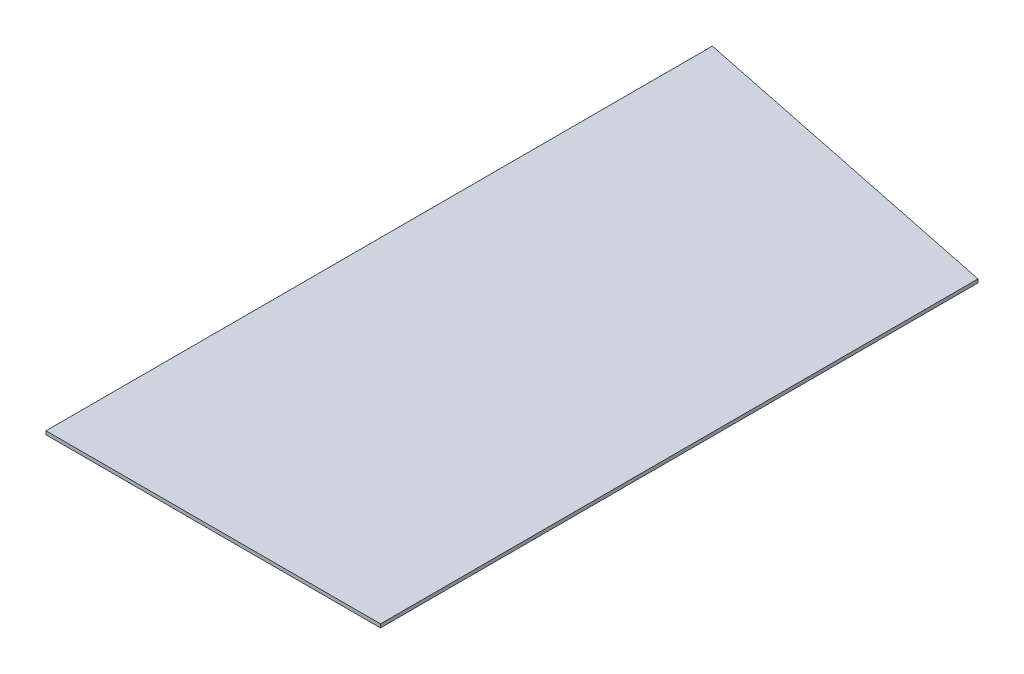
ISO-10303-21;
HEADER;
FILE_DESCRIPTION(('STEP AP214'),'2;1');
FILE_NAME('part.step','',(''),(''),'','','');
FILE_SCHEMA(('AUTOMOTIVE_DESIGN { 1 0 10303 214 1 1 1 1 }'));
ENDSEC;
DATA;
#1=APPLICATION_CONTEXT('core data for automotive mechanical design processes');
#2=APPLICATION_PROTOCOL_DEFINITION('international standard','automotive_design',2000,#1);
#3=PRODUCT_CONTEXT('',#1,'mechanical');
#4=PRODUCT('Part','Part','',(#3));
#5=PRODUCT_RELATED_PRODUCT_CATEGORY('part','',(#4));
#6=PRODUCT_DEFINITION_FORMATION('','',#4);
#7=PRODUCT_DEFINITION_CONTEXT('part definition',#1,'design');
#8=PRODUCT_DEFINITION('design','',#6,#7);
#9=PRODUCT_DEFINITION_SHAPE('','',#8);
#10=(LENGTH_UNIT() NAMED_UNIT(*) SI_UNIT(.MILLI.,.METRE.));
#11=(NAMED_UNIT(*) PLANE_ANGLE_UNIT() SI_UNIT($,.RADIAN.));
#12=(NAMED_UNIT(*) SI_UNIT($,.STERADIAN.) SOLID_ANGLE_UNIT());
#13=UNCERTAINTY_MEASURE_WITH_UNIT(LENGTH_MEASURE(1.E-05),#10,'distance_accuracy_value','');
#14=(GEOMETRIC_REPRESENTATION_CONTEXT(3) GLOBAL_UNCERTAINTY_ASSIGNED_CONTEXT((#13)) GLOBAL_UNIT_ASSIGNED_CONTEXT((#10,
#11,#12)) REPRESENTATION_CONTEXT('',''));
#15=CARTESIAN_POINT('',(0.,0.,0.));
#16=DIRECTION('',(0.,0.,1.));
#17=DIRECTION('',(1.,0.,0.));
#18=AXIS2_PLACEMENT_3D('',#15,#16,#17);
#19=CARTESIAN_POINT('',(-304.8,6.35,-638.571875));
#20=DIRECTION('',(1.,0.,0.));
#21=DIRECTION('',(0.,0.,-1.));
#22=AXIS2_PLACEMENT_3D('',#19,#20,#21);
#23=PLANE('',#22);
#24=DIRECTION('',(0.,0.,1.));
#25=VECTOR('',#24,1.);
#26=CARTESIAN_POINT('',(-304.8,0.,-638.571875));
#27=LINE('',#26,#25);
#28=CARTESIAN_POINT('',(-304.8,0.,-638.571875));
#29=VERTEX_POINT('',#28);
#30=CARTESIAN_POINT('',(-304.8,0.,575.865625));
#31=VERTEX_POINT('',#30);
#32=EDGE_CURVE('E96',#29,#31,#27,.T.);
#33=ORIENTED_EDGE('',*,*,#32,.T.);
#34=DIRECTION('',(0.,-1.,0.));
#35=VECTOR('',#34,1.);
#36=CARTESIAN_POINT('',(-304.8,6.35,575.865625));
#37=LINE('',#36,#35);
#38=CARTESIAN_POINT('',(-304.8,6.35,575.865625));
#39=VERTEX_POINT('',#38);
#40=EDGE_CURVE('E11',#39,#31,#37,.T.);
#41=ORIENTED_EDGE('',*,*,#40,.F.);
#42=DIRECTION('',(0.,0.,1.));
#43=VECTOR('',#42,1.);
#44=CARTESIAN_POINT('',(-304.8,6.35,-638.571875));
#45=LINE('',#44,#43);
#46=CARTESIAN_POINT('',(-304.8,6.35,-638.571875));
#47=VERTEX_POINT('',#46);
#48=EDGE_CURVE('E84',#47,#39,#45,.T.);
#49=ORIENTED_EDGE('',*,*,#48,.F.);
#50=DIRECTION('',(0.,-1.,0.));
#51=VECTOR('',#50,1.);
#52=CARTESIAN_POINT('',(-304.8,6.35,-638.571875));
#53=LINE('',#52,#51);
#54=EDGE_CURVE('E92',#47,#29,#53,.T.);
#55=ORIENTED_EDGE('',*,*,#54,.T.);
#56=EDGE_LOOP('',(#33,#41,#49,#55));
#57=FACE_BOUND('',#56,.T.);
#58=ADVANCED_FACE('F33',(#57),#23,.F.);
#59=CARTESIAN_POINT('',(-304.8,6.35,575.865625));
#60=DIRECTION('',(0.,0.,-1.));
#61=DIRECTION('',(-1.,0.,0.));
#62=AXIS2_PLACEMENT_3D('',#59,#60,#61);
#63=PLANE('',#62);
#64=DIRECTION('',(1.,0.,0.));
#65=VECTOR('',#64,1.);
#66=CARTESIAN_POINT('',(-304.8,0.,575.865625));
#67=LINE('',#66,#65);
#68=CARTESIAN_POINT('',(304.8,0.,575.865625));
#69=VERTEX_POINT('',#68);
#70=EDGE_CURVE('E88',#31,#69,#67,.T.);
#71=ORIENTED_EDGE('',*,*,#70,.T.);
#72=DIRECTION('',(0.,-1.,0.));
#73=VECTOR('',#72,1.);
#74=CARTESIAN_POINT('',(304.8,6.35,575.865625));
#75=LINE('',#74,#73);
#76=CARTESIAN_POINT('',(304.8,6.35,575.865625));
#77=VERTEX_POINT('',#76);
#78=EDGE_CURVE('E41',#77,#69,#75,.T.);
#79=ORIENTED_EDGE('',*,*,#78,.F.);
#80=DIRECTION('',(1.,0.,0.));
#81=VECTOR('',#80,1.);
#82=CARTESIAN_POINT('',(-304.8,6.35,575.865625));
#83=LINE('',#82,#81);
#84=EDGE_CURVE('E79',#39,#77,#83,.T.);
#85=ORIENTED_EDGE('',*,*,#84,.F.);
#86=ORIENTED_EDGE('',*,*,#40,.T.);
#87=EDGE_LOOP('',(#71,#79,#85,#86));
#88=FACE_BOUND('',#87,.T.);
#89=ADVANCED_FACE('F87',(#88),#63,.F.);
#90=CARTESIAN_POINT('',(304.8,6.35,-513.159375));
#91=DIRECTION('',(-1.,0.,0.));
#92=DIRECTION('',(0.,0.,1.));
#93=AXIS2_PLACEMENT_3D('',#90,#91,#92);
#94=PLANE('',#93);
#95=DIRECTION('',(0.,0.,-1.));
#96=VECTOR('',#95,1.);
#97=CARTESIAN_POINT('',(304.8,0.,-513.159375));
#98=LINE('',#97,#96);
#99=CARTESIAN_POINT('',(304.8,0.,-513.159375));
#100=VERTEX_POINT('',#99);
#101=EDGE_CURVE('E66',#69,#100,#98,.T.);
#102=ORIENTED_EDGE('',*,*,#101,.T.);
#103=DIRECTION('',(0.,-1.,0.));
#104=VECTOR('',#103,1.);
#105=CARTESIAN_POINT('',(304.8,6.35,-513.159375));
#106=LINE('',#105,#104);
#107=CARTESIAN_POINT('',(304.8,6.35,-513.159375));
#108=VERTEX_POINT('',#107);
#109=EDGE_CURVE('E89',#108,#100,#106,.T.);
#110=ORIENTED_EDGE('',*,*,#109,.F.);
#111=DIRECTION('',(0.,0.,-1.));
#112=VECTOR('',#111,1.);
#113=CARTESIAN_POINT('',(304.8,6.35,-513.159375));
#114=LINE('',#113,#112);
#115=EDGE_CURVE('E82',#77,#108,#114,.T.);
#116=ORIENTED_EDGE('',*,*,#115,.F.);
#117=ORIENTED_EDGE('',*,*,#78,.T.);
#118=EDGE_LOOP('',(#102,#110,#116,#117));
#119=FACE_BOUND('',#118,.T.);
#120=ADVANCED_FACE('F90',(#119),#94,.F.);
#121=CARTESIAN_POINT('',(-304.8,6.35,-638.571875));
#122=DIRECTION('',(-0.201508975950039,0.,0.979486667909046));
#123=DIRECTION('',(0.979486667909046,0.,0.201508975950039));
#124=AXIS2_PLACEMENT_3D('',#121,#122,#123);
#125=PLANE('',#124);
#126=DIRECTION('',(-0.979486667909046,0.,-0.201508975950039));
#127=VECTOR('',#126,1.);
#128=CARTESIAN_POINT('',(-304.8,0.,-638.571875));
#129=LINE('',#128,#127);
#130=EDGE_CURVE('E72',#100,#29,#129,.T.);
#131=ORIENTED_EDGE('',*,*,#130,.T.);
#132=ORIENTED_EDGE('',*,*,#54,.F.);
#133=DIRECTION('',(-0.979486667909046,0.,-0.201508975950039));
#134=VECTOR('',#133,1.);
#135=CARTESIAN_POINT('',(-304.8,6.35,-638.571875));
#136=LINE('',#135,#134);
#137=EDGE_CURVE('E49',#108,#47,#136,.T.);
#138=ORIENTED_EDGE('',*,*,#137,.F.);
#139=ORIENTED_EDGE('',*,*,#109,.T.);
#140=EDGE_LOOP('',(#131,#132,#138,#139));
#141=FACE_BOUND('',#140,.T.);
#142=ADVANCED_FACE('F103',(#141),#125,.F.);
#143=CARTESIAN_POINT('',(0.,6.35,0.));
#144=DIRECTION('',(0.,1.,0.));
#145=DIRECTION('',(0.,0.,1.));
#146=AXIS2_PLACEMENT_3D('',#143,#144,#145);
#147=PLANE('',#146);
#148=ORIENTED_EDGE('',*,*,#48,.T.);
#149=ORIENTED_EDGE('',*,*,#84,.T.);
#150=ORIENTED_EDGE('',*,*,#115,.T.);
#151=ORIENTED_EDGE('',*,*,#137,.T.);
#152=EDGE_LOOP('',(#148,#149,#150,#151));
#153=FACE_BOUND('',#152,.T.);
#154=ADVANCED_FACE('F80',(#153),#147,.T.);
#155=CARTESIAN_POINT('',(0.,0.,0.));
#156=DIRECTION('',(0.,1.,0.));
#157=DIRECTION('',(0.,0.,1.));
#158=AXIS2_PLACEMENT_3D('',#155,#156,#157);
#159=PLANE('',#158);
#160=ORIENTED_EDGE('',*,*,#32,.F.);
#161=ORIENTED_EDGE('',*,*,#130,.F.);
#162=ORIENTED_EDGE('',*,*,#101,.F.);
#163=ORIENTED_EDGE('',*,*,#70,.F.);
#164=EDGE_LOOP('',(#160,#161,#162,#163));
#165=FACE_BOUND('',#164,.T.);
#166=ADVANCED_FACE('F106',(#165),#159,.F.);
#167=CLOSED_SHELL('',(#58,#89,#120,#142,#154,#166));
#168=MANIFOLD_SOLID_BREP('B2',#167);
#169=ADVANCED_BREP_SHAPE_REPRESENTATION('',(#18,#168),#14);
#170=SHAPE_DEFINITION_REPRESENTATION(#9,#169);
ENDSEC;
END-ISO-10303-21;
